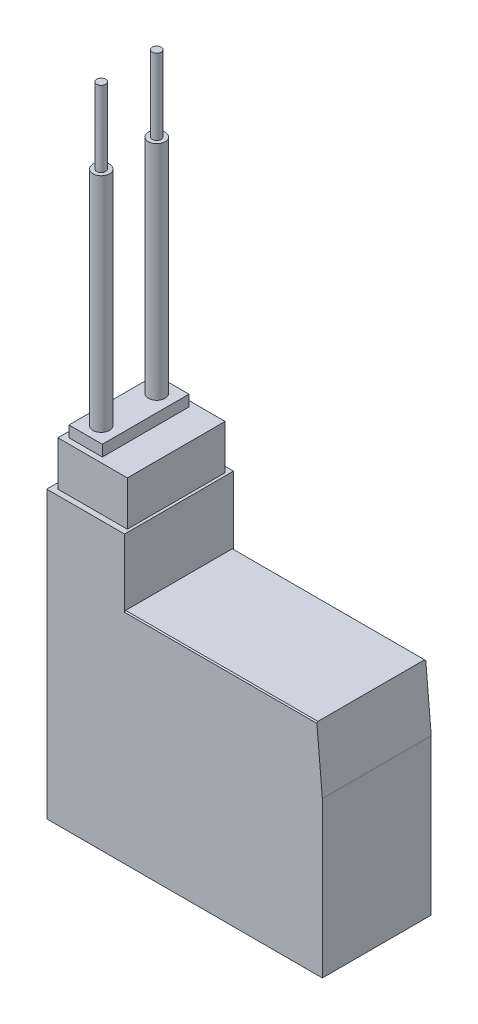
ISO-10303-21;
HEADER;
FILE_DESCRIPTION(('STEP AP214'),'2;1');
FILE_NAME('part.step','',(''),(''),'','','');
FILE_SCHEMA(('AUTOMOTIVE_DESIGN { 1 0 10303 214 1 1 1 1 }'));
ENDSEC;
DATA;
#1=APPLICATION_CONTEXT('core data for automotive mechanical design processes');
#2=APPLICATION_PROTOCOL_DEFINITION('international standard','automotive_design',2000,#1);
#3=PRODUCT_CONTEXT('',#1,'mechanical');
#4=PRODUCT('Part','Part','',(#3));
#5=PRODUCT_RELATED_PRODUCT_CATEGORY('part','',(#4));
#6=PRODUCT_DEFINITION_FORMATION('','',#4);
#7=PRODUCT_DEFINITION_CONTEXT('part definition',#1,'design');
#8=PRODUCT_DEFINITION('design','',#6,#7);
#9=PRODUCT_DEFINITION_SHAPE('','',#8);
#10=(LENGTH_UNIT() NAMED_UNIT(*) SI_UNIT(.MILLI.,.METRE.));
#11=(NAMED_UNIT(*) PLANE_ANGLE_UNIT() SI_UNIT($,.RADIAN.));
#12=(NAMED_UNIT(*) SI_UNIT($,.STERADIAN.) SOLID_ANGLE_UNIT());
#13=UNCERTAINTY_MEASURE_WITH_UNIT(LENGTH_MEASURE(1.E-05),#10,'distance_accuracy_value','');
#14=(GEOMETRIC_REPRESENTATION_CONTEXT(3) GLOBAL_UNCERTAINTY_ASSIGNED_CONTEXT((#13)) GLOBAL_UNIT_ASSIGNED_CONTEXT((#10,
#11,#12)) REPRESENTATION_CONTEXT('',''));
#15=CARTESIAN_POINT('',(0.,0.,0.));
#16=DIRECTION('',(0.,0.,1.));
#17=DIRECTION('',(1.,0.,0.));
#18=AXIS2_PLACEMENT_3D('',#15,#16,#17);
#19=CARTESIAN_POINT('',(2.5,50.7,-2.5));
#20=DIRECTION('',(0.,1.,0.));
#21=DIRECTION('',(0.,0.,1.));
#22=AXIS2_PLACEMENT_3D('',#19,#20,#21);
#23=PLANE('',#22);
#24=CARTESIAN_POINT('',(2.5,50.7,-2.5));
#25=DIRECTION('',(0.,1.,0.));
#26=DIRECTION('',(0.,0.,1.));
#27=AXIS2_PLACEMENT_3D('',#24,#25,#26);
#28=CIRCLE('',#27,0.75);
#29=CARTESIAN_POINT('',(2.5,50.7,-1.75));
#30=VERTEX_POINT('',#29);
#31=EDGE_CURVE('E157',#30,#30,#28,.T.);
#32=ORIENTED_EDGE('',*,*,#31,.T.);
#33=EDGE_LOOP('',(#32));
#34=FACE_BOUND('',#33,.T.);
#35=CARTESIAN_POINT('',(2.5,50.7,-2.5));
#36=DIRECTION('',(0.,1.,0.));
#37=DIRECTION('',(0.,0.,1.));
#38=AXIS2_PLACEMENT_3D('',#35,#36,#37);
#39=CIRCLE('',#38,0.4);
#40=CARTESIAN_POINT('',(2.5,50.7,-2.1));
#41=VERTEX_POINT('',#40);
#42=EDGE_CURVE('E430',#41,#41,#39,.T.);
#43=ORIENTED_EDGE('',*,*,#42,.F.);
#44=EDGE_LOOP('',(#43));
#45=FACE_BOUND('',#44,.T.);
#46=ADVANCED_FACE('F29',(#34,#45),#23,.T.);
#47=CARTESIAN_POINT('',(2.5,50.7,2.5));
#48=DIRECTION('',(0.,-1.,0.));
#49=DIRECTION('',(0.,0.,-1.));
#50=AXIS2_PLACEMENT_3D('',#47,#48,#49);
#51=PLANE('',#50);
#52=CARTESIAN_POINT('',(2.5,50.7,2.5));
#53=DIRECTION('',(0.,1.,0.));
#54=DIRECTION('',(0.,0.,-1.));
#55=AXIS2_PLACEMENT_3D('',#52,#53,#54);
#56=CIRCLE('',#55,0.75);
#57=CARTESIAN_POINT('',(2.5,50.7,1.75));
#58=VERTEX_POINT('',#57);
#59=EDGE_CURVE('E427',#58,#58,#56,.T.);
#60=ORIENTED_EDGE('',*,*,#59,.T.);
#61=EDGE_LOOP('',(#60));
#62=FACE_BOUND('',#61,.T.);
#63=CARTESIAN_POINT('',(2.5,50.7,2.5));
#64=DIRECTION('',(0.,-1.,0.));
#65=DIRECTION('',(0.,0.,-1.));
#66=AXIS2_PLACEMENT_3D('',#63,#64,#65);
#67=CIRCLE('',#66,0.4);
#68=CARTESIAN_POINT('',(2.5,50.7,2.1));
#69=VERTEX_POINT('',#68);
#70=EDGE_CURVE('E291',#69,#69,#67,.F.);
#71=ORIENTED_EDGE('',*,*,#70,.F.);
#72=EDGE_LOOP('',(#71));
#73=FACE_BOUND('',#72,.T.);
#74=ADVANCED_FACE('F307',(#62,#73),#51,.F.);
#75=CARTESIAN_POINT('',(1.,30.7,-3.9));
#76=DIRECTION('',(0.,1.,0.));
#77=DIRECTION('',(0.,0.,1.));
#78=AXIS2_PLACEMENT_3D('',#75,#76,#77);
#79=PLANE('',#78);
#80=CARTESIAN_POINT('',(2.5,30.7,-2.5));
#81=DIRECTION('',(0.,1.,0.));
#82=DIRECTION('',(0.,0.,1.));
#83=AXIS2_PLACEMENT_3D('',#80,#81,#82);
#84=CIRCLE('',#83,0.75);
#85=CARTESIAN_POINT('',(2.5,30.7,-1.75));
#86=VERTEX_POINT('',#85);
#87=EDGE_CURVE('E435',#86,#86,#84,.T.);
#88=ORIENTED_EDGE('',*,*,#87,.F.);
#89=EDGE_LOOP('',(#88));
#90=FACE_BOUND('',#89,.T.);
#91=DIRECTION('',(0.,0.,1.));
#92=VECTOR('',#91,1.);
#93=CARTESIAN_POINT('',(1.,30.7,-3.9));
#94=LINE('',#93,#92);
#95=CARTESIAN_POINT('',(1.,30.7,-3.9));
#96=VERTEX_POINT('',#95);
#97=CARTESIAN_POINT('',(1.,30.7,3.9));
#98=VERTEX_POINT('',#97);
#99=EDGE_CURVE('E168',#96,#98,#94,.T.);
#100=ORIENTED_EDGE('',*,*,#99,.T.);
#101=DIRECTION('',(1.,0.,0.));
#102=VECTOR('',#101,1.);
#103=CARTESIAN_POINT('',(1.,30.7,3.9));
#104=LINE('',#103,#102);
#105=CARTESIAN_POINT('',(4.,30.7,3.9));
#106=VERTEX_POINT('',#105);
#107=EDGE_CURVE('E443',#98,#106,#104,.T.);
#108=ORIENTED_EDGE('',*,*,#107,.T.);
#109=DIRECTION('',(0.,0.,-1.));
#110=VECTOR('',#109,1.);
#111=CARTESIAN_POINT('',(4.,30.7,-3.9));
#112=LINE('',#111,#110);
#113=CARTESIAN_POINT('',(4.,30.7,-3.9));
#114=VERTEX_POINT('',#113);
#115=EDGE_CURVE('E177',#106,#114,#112,.T.);
#116=ORIENTED_EDGE('',*,*,#115,.T.);
#117=DIRECTION('',(-1.,0.,0.));
#118=VECTOR('',#117,1.);
#119=CARTESIAN_POINT('',(1.,30.7,-3.9));
#120=LINE('',#119,#118);
#121=EDGE_CURVE('E173',#114,#96,#120,.T.);
#122=ORIENTED_EDGE('',*,*,#121,.T.);
#123=EDGE_LOOP('',(#100,#108,#116,#122));
#124=FACE_BOUND('',#123,.T.);
#125=CARTESIAN_POINT('',(2.5,30.7,2.5));
#126=DIRECTION('',(0.,1.,0.));
#127=DIRECTION('',(0.,0.,-1.));
#128=AXIS2_PLACEMENT_3D('',#125,#126,#127);
#129=CIRCLE('',#128,0.75);
#130=CARTESIAN_POINT('',(2.5,30.7,1.75));
#131=VERTEX_POINT('',#130);
#132=EDGE_CURVE('E423',#131,#131,#129,.T.);
#133=ORIENTED_EDGE('',*,*,#132,.F.);
#134=EDGE_LOOP('',(#133));
#135=FACE_BOUND('',#134,.T.);
#136=ADVANCED_FACE('F309',(#90,#124,#135),#79,.T.);
#137=CARTESIAN_POINT('',(0.500000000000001,29.7,4.4));
#138=DIRECTION('',(0.,-1.,0.));
#139=DIRECTION('',(0.,0.,-1.));
#140=AXIS2_PLACEMENT_3D('',#137,#138,#139);
#141=PLANE('',#140);
#142=DIRECTION('',(0.,0.,1.));
#143=VECTOR('',#142,1.);
#144=CARTESIAN_POINT('',(0.500000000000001,29.7,4.4));
#145=LINE('',#144,#143);
#146=CARTESIAN_POINT('',(0.5,29.7,-4.4));
#147=VERTEX_POINT('',#146);
#148=CARTESIAN_POINT('',(0.500000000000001,29.7,4.4));
#149=VERTEX_POINT('',#148);
#150=EDGE_CURVE('E195',#147,#149,#145,.T.);
#151=ORIENTED_EDGE('',*,*,#150,.T.);
#152=DIRECTION('',(1.,0.,0.));
#153=VECTOR('',#152,1.);
#154=CARTESIAN_POINT('',(0.500000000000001,29.7,4.4));
#155=LINE('',#154,#153);
#156=CARTESIAN_POINT('',(6.75,29.7,4.4));
#157=VERTEX_POINT('',#156);
#158=EDGE_CURVE('E198',#149,#157,#155,.T.);
#159=ORIENTED_EDGE('',*,*,#158,.T.);
#160=DIRECTION('',(0.,0.,-1.));
#161=VECTOR('',#160,1.);
#162=CARTESIAN_POINT('',(6.75,29.7,4.4));
#163=LINE('',#162,#161);
#164=CARTESIAN_POINT('',(6.75,29.7,-4.4));
#165=VERTEX_POINT('',#164);
#166=EDGE_CURVE('E200',#157,#165,#163,.T.);
#167=ORIENTED_EDGE('',*,*,#166,.T.);
#168=DIRECTION('',(-1.,0.,0.));
#169=VECTOR('',#168,1.);
#170=CARTESIAN_POINT('',(0.5,29.7,-4.4));
#171=LINE('',#170,#169);
#172=EDGE_CURVE('E202',#165,#147,#171,.T.);
#173=ORIENTED_EDGE('',*,*,#172,.T.);
#174=EDGE_LOOP('',(#151,#159,#167,#173));
#175=FACE_BOUND('',#174,.T.);
#176=DIRECTION('',(0.,0.,1.));
#177=VECTOR('',#176,1.);
#178=CARTESIAN_POINT('',(1.,29.7,-3.9));
#179=LINE('',#178,#177);
#180=CARTESIAN_POINT('',(1.,29.7,-3.9));
#181=VERTEX_POINT('',#180);
#182=CARTESIAN_POINT('',(1.,29.7,3.9));
#183=VERTEX_POINT('',#182);
#184=EDGE_CURVE('E146',#181,#183,#179,.T.);
#185=ORIENTED_EDGE('',*,*,#184,.F.);
#186=DIRECTION('',(-1.,0.,0.));
#187=VECTOR('',#186,1.);
#188=CARTESIAN_POINT('',(1.,29.7,-3.9));
#189=LINE('',#188,#187);
#190=CARTESIAN_POINT('',(4.,29.7,-3.9));
#191=VERTEX_POINT('',#190);
#192=EDGE_CURVE('E149',#191,#181,#189,.T.);
#193=ORIENTED_EDGE('',*,*,#192,.F.);
#194=DIRECTION('',(0.,0.,-1.));
#195=VECTOR('',#194,1.);
#196=CARTESIAN_POINT('',(4.,29.7,-3.9));
#197=LINE('',#196,#195);
#198=CARTESIAN_POINT('',(4.,29.7,3.9));
#199=VERTEX_POINT('',#198);
#200=EDGE_CURVE('E169',#199,#191,#197,.T.);
#201=ORIENTED_EDGE('',*,*,#200,.F.);
#202=DIRECTION('',(1.,0.,0.));
#203=VECTOR('',#202,1.);
#204=CARTESIAN_POINT('',(1.,29.7,3.9));
#205=LINE('',#204,#203);
#206=EDGE_CURVE('E152',#183,#199,#205,.T.);
#207=ORIENTED_EDGE('',*,*,#206,.F.);
#208=EDGE_LOOP('',(#185,#193,#201,#207));
#209=FACE_BOUND('',#208,.T.);
#210=ADVANCED_FACE('F148',(#175,#209),#141,.F.);
#211=CARTESIAN_POINT('',(0.,25.7,-14.1195444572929));
#212=DIRECTION('',(0.,1.,0.));
#213=DIRECTION('',(0.,0.,1.));
#214=AXIS2_PLACEMENT_3D('',#211,#212,#213);
#215=PLANE('',#214);
#216=DIRECTION('',(0.,0.,1.));
#217=VECTOR('',#216,1.);
#218=CARTESIAN_POINT('',(7.,25.7,-14.1195444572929));
#219=LINE('',#218,#217);
#220=CARTESIAN_POINT('',(7.,25.7,-4.9));
#221=VERTEX_POINT('',#220);
#222=CARTESIAN_POINT('',(7.,25.7,4.9));
#223=VERTEX_POINT('',#222);
#224=EDGE_CURVE('E223',#221,#223,#219,.T.);
#225=ORIENTED_EDGE('',*,*,#224,.F.);
#226=DIRECTION('',(-1.,0.,0.));
#227=VECTOR('',#226,1.);
#228=CARTESIAN_POINT('',(0.,25.7,-4.9));
#229=LINE('',#228,#227);
#230=CARTESIAN_POINT('',(0.,25.7,-4.9));
#231=VERTEX_POINT('',#230);
#232=EDGE_CURVE('E219',#221,#231,#229,.T.);
#233=ORIENTED_EDGE('',*,*,#232,.T.);
#234=DIRECTION('',(0.,0.,1.));
#235=VECTOR('',#234,1.);
#236=CARTESIAN_POINT('',(0.,25.7,-14.1195444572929));
#237=LINE('',#236,#235);
#238=CARTESIAN_POINT('',(0.,25.7,4.9));
#239=VERTEX_POINT('',#238);
#240=EDGE_CURVE('E222',#231,#239,#237,.T.);
#241=ORIENTED_EDGE('',*,*,#240,.T.);
#242=DIRECTION('',(-1.,0.,0.));
#243=VECTOR('',#242,1.);
#244=CARTESIAN_POINT('',(0.,25.7,4.9));
#245=LINE('',#244,#243);
#246=EDGE_CURVE('E215',#223,#239,#245,.T.);
#247=ORIENTED_EDGE('',*,*,#246,.F.);
#248=EDGE_LOOP('',(#225,#233,#241,#247));
#249=FACE_BOUND('',#248,.T.);
#250=DIRECTION('',(1.,0.,0.));
#251=VECTOR('',#250,1.);
#252=CARTESIAN_POINT('',(0.500000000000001,25.7,4.4));
#253=LINE('',#252,#251);
#254=CARTESIAN_POINT('',(0.500000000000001,25.7,4.4));
#255=VERTEX_POINT('',#254);
#256=CARTESIAN_POINT('',(6.75,25.7,4.4));
#257=VERTEX_POINT('',#256);
#258=EDGE_CURVE('E188',#255,#257,#253,.T.);
#259=ORIENTED_EDGE('',*,*,#258,.F.);
#260=DIRECTION('',(0.,0.,1.));
#261=VECTOR('',#260,1.);
#262=CARTESIAN_POINT('',(0.500000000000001,25.7,4.4));
#263=LINE('',#262,#261);
#264=CARTESIAN_POINT('',(0.5,25.7,-4.4));
#265=VERTEX_POINT('',#264);
#266=EDGE_CURVE('E185',#265,#255,#263,.T.);
#267=ORIENTED_EDGE('',*,*,#266,.F.);
#268=DIRECTION('',(-1.,0.,0.));
#269=VECTOR('',#268,1.);
#270=CARTESIAN_POINT('',(0.5,25.7,-4.4));
#271=LINE('',#270,#269);
#272=CARTESIAN_POINT('',(6.75,25.7,-4.4));
#273=VERTEX_POINT('',#272);
#274=EDGE_CURVE('E193',#273,#265,#271,.T.);
#275=ORIENTED_EDGE('',*,*,#274,.F.);
#276=DIRECTION('',(0.,0.,-1.));
#277=VECTOR('',#276,1.);
#278=CARTESIAN_POINT('',(6.75,25.7,4.4));
#279=LINE('',#278,#277);
#280=EDGE_CURVE('E190',#257,#273,#279,.T.);
#281=ORIENTED_EDGE('',*,*,#280,.F.);
#282=EDGE_LOOP('',(#259,#267,#275,#281));
#283=FACE_BOUND('',#282,.T.);
#284=ADVANCED_FACE('F348',(#249,#283),#215,.T.);
#285=CARTESIAN_POINT('',(0.,19.7,-4.9));
#286=DIRECTION('',(0.,1.,0.));
#287=DIRECTION('',(0.,0.,1.));
#288=AXIS2_PLACEMENT_3D('',#285,#286,#287);
#289=PLANE('',#288);
#290=DIRECTION('',(0.,0.,1.));
#291=VECTOR('',#290,1.);
#292=CARTESIAN_POINT('',(7.,19.7,-14.1195444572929));
#293=LINE('',#292,#291);
#294=CARTESIAN_POINT('',(7.,19.7,-4.8));
#295=VERTEX_POINT('',#294);
#296=CARTESIAN_POINT('',(7.,19.7,4.8));
#297=VERTEX_POINT('',#296);
#298=EDGE_CURVE('E218',#295,#297,#293,.T.);
#299=ORIENTED_EDGE('',*,*,#298,.T.);
#300=DIRECTION('',(1.,0.,0.));
#301=VECTOR('',#300,1.);
#302=CARTESIAN_POINT('',(24.3,19.7,4.8));
#303=LINE('',#302,#301);
#304=CARTESIAN_POINT('',(24.3,19.7,4.8));
#305=VERTEX_POINT('',#304);
#306=EDGE_CURVE('E240',#297,#305,#303,.T.);
#307=ORIENTED_EDGE('',*,*,#306,.T.);
#308=DIRECTION('',(0.,0.,1.));
#309=VECTOR('',#308,1.);
#310=CARTESIAN_POINT('',(24.3,19.7,-4.9));
#311=LINE('',#310,#309);
#312=CARTESIAN_POINT('',(24.3,19.7,-4.8));
#313=VERTEX_POINT('',#312);
#314=EDGE_CURVE('E268',#313,#305,#311,.T.);
#315=ORIENTED_EDGE('',*,*,#314,.F.);
#316=DIRECTION('',(-1.,0.,0.));
#317=VECTOR('',#316,1.);
#318=CARTESIAN_POINT('',(0.,19.7,-4.8));
#319=LINE('',#318,#317);
#320=EDGE_CURVE('E237',#313,#295,#319,.T.);
#321=ORIENTED_EDGE('',*,*,#320,.T.);
#322=EDGE_LOOP('',(#299,#307,#315,#321));
#323=FACE_BOUND('',#322,.T.);
#324=ADVANCED_FACE('F256',(#323),#289,.T.);
#325=CARTESIAN_POINT('',(0.,0.,-4.9));
#326=DIRECTION('',(-1.,0.,0.));
#327=DIRECTION('',(0.,0.,1.));
#328=AXIS2_PLACEMENT_3D('',#325,#326,#327);
#329=PLANE('',#328);
#330=DIRECTION('',(0.,-1.,0.));
#331=VECTOR('',#330,1.);
#332=CARTESIAN_POINT('',(0.,0.,4.9));
#333=LINE('',#332,#331);
#334=CARTESIAN_POINT('',(0.,0.,4.9));
#335=VERTEX_POINT('',#334);
#336=EDGE_CURVE('E226',#239,#335,#333,.T.);
#337=ORIENTED_EDGE('',*,*,#336,.F.);
#338=ORIENTED_EDGE('',*,*,#240,.F.);
#339=DIRECTION('',(0.,-1.,0.));
#340=VECTOR('',#339,1.);
#341=CARTESIAN_POINT('',(0.,0.,-4.9));
#342=LINE('',#341,#340);
#343=CARTESIAN_POINT('',(0.,0.,-4.9));
#344=VERTEX_POINT('',#343);
#345=EDGE_CURVE('E274',#231,#344,#342,.T.);
#346=ORIENTED_EDGE('',*,*,#345,.T.);
#347=DIRECTION('',(0.,0.,1.));
#348=VECTOR('',#347,1.);
#349=CARTESIAN_POINT('',(0.,0.,-4.9));
#350=LINE('',#349,#348);
#351=EDGE_CURVE('E289',#344,#335,#350,.T.);
#352=ORIENTED_EDGE('',*,*,#351,.T.);
#353=EDGE_LOOP('',(#337,#338,#346,#352));
#354=FACE_BOUND('',#353,.T.);
#355=ADVANCED_FACE('F31',(#354),#329,.T.);
#356=CARTESIAN_POINT('',(24.3,19.7,-4.9));
#357=DIRECTION('',(0.996194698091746,0.0871557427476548,0.));
#358=DIRECTION('',(-0.0871557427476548,0.996194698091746,0.));
#359=AXIS2_PLACEMENT_3D('',#356,#357,#358);
#360=PLANE('',#359);
#361=ORIENTED_EDGE('',*,*,#314,.T.);
#362=DIRECTION('',(0.0617457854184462,-0.705757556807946,0.705757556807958));
#363=VECTOR('',#362,1.);
#364=CARTESIAN_POINT('',(23.8772977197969,24.5315091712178,-0.0315091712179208));
#365=LINE('',#364,#363);
#366=CARTESIAN_POINT('',(24.3087488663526,19.6,4.9));
#367=VERTEX_POINT('',#366);
#368=EDGE_CURVE('E244',#305,#367,#365,.T.);
#369=ORIENTED_EDGE('',*,*,#368,.T.);
#370=DIRECTION('',(-0.0871557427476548,0.996194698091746,0.));
#371=VECTOR('',#370,1.);
#372=CARTESIAN_POINT('',(24.3,19.7,4.9));
#373=LINE('',#372,#371);
#374=CARTESIAN_POINT('',(24.8,13.9849738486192,4.9));
#375=VERTEX_POINT('',#374);
#376=EDGE_CURVE('E266',#375,#367,#373,.T.);
#377=ORIENTED_EDGE('',*,*,#376,.F.);
#378=DIRECTION('',(0.,0.,1.));
#379=VECTOR('',#378,1.);
#380=CARTESIAN_POINT('',(24.8,13.9849738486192,-4.9));
#381=LINE('',#380,#379);
#382=CARTESIAN_POINT('',(24.8,13.9849738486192,-4.9));
#383=VERTEX_POINT('',#382);
#384=EDGE_CURVE('E292',#383,#375,#381,.T.);
#385=ORIENTED_EDGE('',*,*,#384,.F.);
#386=DIRECTION('',(-0.0871557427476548,0.996194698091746,0.));
#387=VECTOR('',#386,1.);
#388=CARTESIAN_POINT('',(24.3,19.7,-4.9));
#389=LINE('',#388,#387);
#390=CARTESIAN_POINT('',(24.3087488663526,19.6,-4.9));
#391=VERTEX_POINT('',#390);
#392=EDGE_CURVE('E287',#383,#391,#389,.T.);
#393=ORIENTED_EDGE('',*,*,#392,.T.);
#394=DIRECTION('',(0.0617457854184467,-0.705757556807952,-0.705757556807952));
#395=VECTOR('',#394,1.);
#396=CARTESIAN_POINT('',(24.304357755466,19.6501906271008,-4.84980937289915));
#397=LINE('',#396,#395);
#398=EDGE_CURVE('E242',#391,#313,#397,.F.);
#399=ORIENTED_EDGE('',*,*,#398,.T.);
#400=EDGE_LOOP('',(#361,#369,#377,#385,#393,#399));
#401=FACE_BOUND('',#400,.T.);
#402=ADVANCED_FACE('F265',(#401),#360,.T.);
#403=CARTESIAN_POINT('',(24.8,0.,-4.9));
#404=DIRECTION('',(1.,0.,0.));
#405=DIRECTION('',(0.,0.,-1.));
#406=AXIS2_PLACEMENT_3D('',#403,#404,#405);
#407=PLANE('',#406);
#408=DIRECTION('',(0.,1.,0.));
#409=VECTOR('',#408,1.);
#410=CARTESIAN_POINT('',(24.8,0.,4.9));
#411=LINE('',#410,#409);
#412=CARTESIAN_POINT('',(24.8,0.,4.9));
#413=VERTEX_POINT('',#412);
#414=EDGE_CURVE('E273',#413,#375,#411,.T.);
#415=ORIENTED_EDGE('',*,*,#414,.F.);
#416=DIRECTION('',(0.,0.,1.));
#417=VECTOR('',#416,1.);
#418=CARTESIAN_POINT('',(24.8,0.,-4.9));
#419=LINE('',#418,#417);
#420=CARTESIAN_POINT('',(24.8,0.,-4.9));
#421=VERTEX_POINT('',#420);
#422=EDGE_CURVE('E294',#421,#413,#419,.T.);
#423=ORIENTED_EDGE('',*,*,#422,.F.);
#424=DIRECTION('',(0.,1.,0.));
#425=VECTOR('',#424,1.);
#426=CARTESIAN_POINT('',(24.8,0.,-4.9));
#427=LINE('',#426,#425);
#428=EDGE_CURVE('E284',#421,#383,#427,.T.);
#429=ORIENTED_EDGE('',*,*,#428,.T.);
#430=ORIENTED_EDGE('',*,*,#384,.T.);
#431=EDGE_LOOP('',(#415,#423,#429,#430));
#432=FACE_BOUND('',#431,.T.);
#433=ADVANCED_FACE('F380',(#432),#407,.T.);
#434=CARTESIAN_POINT('',(0.,0.,-4.9));
#435=DIRECTION('',(0.,-1.,0.));
#436=DIRECTION('',(0.,0.,-1.));
#437=AXIS2_PLACEMENT_3D('',#434,#435,#436);
#438=PLANE('',#437);
#439=DIRECTION('',(1.,0.,0.));
#440=VECTOR('',#439,1.);
#441=CARTESIAN_POINT('',(0.,0.,4.9));
#442=LINE('',#441,#440);
#443=EDGE_CURVE('E279',#335,#413,#442,.T.);
#444=ORIENTED_EDGE('',*,*,#443,.F.);
#445=ORIENTED_EDGE('',*,*,#351,.F.);
#446=DIRECTION('',(1.,0.,0.));
#447=VECTOR('',#446,1.);
#448=CARTESIAN_POINT('',(0.,0.,-4.9));
#449=LINE('',#448,#447);
#450=EDGE_CURVE('E277',#344,#421,#449,.T.);
#451=ORIENTED_EDGE('',*,*,#450,.T.);
#452=ORIENTED_EDGE('',*,*,#422,.T.);
#453=EDGE_LOOP('',(#444,#445,#451,#452));
#454=FACE_BOUND('',#453,.T.);
#455=ADVANCED_FACE('F375',(#454),#438,.T.);
#456=CARTESIAN_POINT('',(0.,19.7,-4.9));
#457=DIRECTION('',(0.,0.,-1.));
#458=DIRECTION('',(-1.,0.,0.));
#459=AXIS2_PLACEMENT_3D('',#456,#457,#458);
#460=PLANE('',#459);
#461=DIRECTION('',(0.,1.,0.));
#462=VECTOR('',#461,1.);
#463=CARTESIAN_POINT('',(7.,19.7,-4.9));
#464=LINE('',#463,#462);
#465=CARTESIAN_POINT('',(7.,19.6,-4.9));
#466=VERTEX_POINT('',#465);
#467=EDGE_CURVE('E44',#466,#221,#464,.T.);
#468=ORIENTED_EDGE('',*,*,#467,.F.);
#469=DIRECTION('',(1.,0.,0.));
#470=VECTOR('',#469,1.);
#471=CARTESIAN_POINT('',(0.,19.6,-4.9));
#472=LINE('',#471,#470);
#473=EDGE_CURVE('E48',#466,#391,#472,.T.);
#474=ORIENTED_EDGE('',*,*,#473,.T.);
#475=ORIENTED_EDGE('',*,*,#392,.F.);
#476=ORIENTED_EDGE('',*,*,#428,.F.);
#477=ORIENTED_EDGE('',*,*,#450,.F.);
#478=ORIENTED_EDGE('',*,*,#345,.F.);
#479=ORIENTED_EDGE('',*,*,#232,.F.);
#480=EDGE_LOOP('',(#468,#474,#475,#476,#477,#478,#479));
#481=FACE_BOUND('',#480,.T.);
#482=ADVANCED_FACE('F372',(#481),#460,.T.);
#483=CARTESIAN_POINT('',(0.,19.7,4.9));
#484=DIRECTION('',(0.,0.,-1.));
#485=DIRECTION('',(-1.,0.,0.));
#486=AXIS2_PLACEMENT_3D('',#483,#484,#485);
#487=PLANE('',#486);
#488=ORIENTED_EDGE('',*,*,#376,.T.);
#489=DIRECTION('',(-1.,0.,0.));
#490=VECTOR('',#489,1.);
#491=CARTESIAN_POINT('',(7.,19.6,4.9));
#492=LINE('',#491,#490);
#493=CARTESIAN_POINT('',(7.,19.6,4.9));
#494=VERTEX_POINT('',#493);
#495=EDGE_CURVE('E235',#367,#494,#492,.T.);
#496=ORIENTED_EDGE('',*,*,#495,.T.);
#497=DIRECTION('',(0.,1.,0.));
#498=VECTOR('',#497,1.);
#499=CARTESIAN_POINT('',(7.,19.7,4.9));
#500=LINE('',#499,#498);
#501=EDGE_CURVE('E214',#494,#223,#500,.T.);
#502=ORIENTED_EDGE('',*,*,#501,.T.);
#503=ORIENTED_EDGE('',*,*,#246,.T.);
#504=ORIENTED_EDGE('',*,*,#336,.T.);
#505=ORIENTED_EDGE('',*,*,#443,.T.);
#506=ORIENTED_EDGE('',*,*,#414,.T.);
#507=EDGE_LOOP('',(#488,#496,#502,#503,#504,#505,#506));
#508=FACE_BOUND('',#507,.T.);
#509=ADVANCED_FACE('F270',(#508),#487,.F.);
#510=CARTESIAN_POINT('',(7.,19.7,-14.1195444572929));
#511=DIRECTION('',(1.,0.,0.));
#512=DIRECTION('',(0.,0.,-1.));
#513=AXIS2_PLACEMENT_3D('',#510,#511,#512);
#514=PLANE('',#513);
#515=ORIENTED_EDGE('',*,*,#298,.F.);
#516=DIRECTION('',(0.,0.707106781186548,0.707106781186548));
#517=VECTOR('',#516,1.);
#518=CARTESIAN_POINT('',(7.,19.7,-4.8));
#519=LINE('',#518,#517);
#520=EDGE_CURVE('E11',#295,#466,#519,.F.);
#521=ORIENTED_EDGE('',*,*,#520,.T.);
#522=ORIENTED_EDGE('',*,*,#467,.T.);
#523=ORIENTED_EDGE('',*,*,#224,.T.);
#524=ORIENTED_EDGE('',*,*,#501,.F.);
#525=DIRECTION('',(0.,0.707106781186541,-0.707106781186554));
#526=VECTOR('',#525,1.);
#527=CARTESIAN_POINT('',(7.,19.6,4.9));
#528=LINE('',#527,#526);
#529=EDGE_CURVE('E37',#494,#297,#528,.T.);
#530=ORIENTED_EDGE('',*,*,#529,.T.);
#531=EDGE_LOOP('',(#515,#521,#522,#523,#524,#530));
#532=FACE_BOUND('',#531,.T.);
#533=ADVANCED_FACE('F249',(#532),#514,.T.);
#534=CARTESIAN_POINT('',(0.500000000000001,29.7,4.4));
#535=DIRECTION('',(1.,0.,0.));
#536=DIRECTION('',(0.,0.,-1.));
#537=AXIS2_PLACEMENT_3D('',#534,#535,#536);
#538=PLANE('',#537);
#539=ORIENTED_EDGE('',*,*,#266,.T.);
#540=DIRECTION('',(0.,-1.,0.));
#541=VECTOR('',#540,1.);
#542=CARTESIAN_POINT('',(0.500000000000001,29.7,4.4));
#543=LINE('',#542,#541);
#544=EDGE_CURVE('E212',#149,#255,#543,.T.);
#545=ORIENTED_EDGE('',*,*,#544,.F.);
#546=ORIENTED_EDGE('',*,*,#150,.F.);
#547=DIRECTION('',(0.,-1.,0.));
#548=VECTOR('',#547,1.);
#549=CARTESIAN_POINT('',(0.5,29.7,-4.4));
#550=LINE('',#549,#548);
#551=EDGE_CURVE('E204',#147,#265,#550,.T.);
#552=ORIENTED_EDGE('',*,*,#551,.T.);
#553=EDGE_LOOP('',(#539,#545,#546,#552));
#554=FACE_BOUND('',#553,.T.);
#555=ADVANCED_FACE('F360',(#554),#538,.F.);
#556=CARTESIAN_POINT('',(0.500000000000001,29.7,4.4));
#557=DIRECTION('',(0.,0.,-1.));
#558=DIRECTION('',(-1.,0.,0.));
#559=AXIS2_PLACEMENT_3D('',#556,#557,#558);
#560=PLANE('',#559);
#561=ORIENTED_EDGE('',*,*,#258,.T.);
#562=DIRECTION('',(0.,-1.,0.));
#563=VECTOR('',#562,1.);
#564=CARTESIAN_POINT('',(6.75,29.7,4.4));
#565=LINE('',#564,#563);
#566=EDGE_CURVE('E209',#157,#257,#565,.T.);
#567=ORIENTED_EDGE('',*,*,#566,.F.);
#568=ORIENTED_EDGE('',*,*,#158,.F.);
#569=ORIENTED_EDGE('',*,*,#544,.T.);
#570=EDGE_LOOP('',(#561,#567,#568,#569));
#571=FACE_BOUND('',#570,.T.);
#572=ADVANCED_FACE('F356',(#571),#560,.F.);
#573=CARTESIAN_POINT('',(6.75,29.7,4.4));
#574=DIRECTION('',(-1.,0.,0.));
#575=DIRECTION('',(0.,0.,1.));
#576=AXIS2_PLACEMENT_3D('',#573,#574,#575);
#577=PLANE('',#576);
#578=ORIENTED_EDGE('',*,*,#280,.T.);
#579=DIRECTION('',(0.,-1.,0.));
#580=VECTOR('',#579,1.);
#581=CARTESIAN_POINT('',(6.75,29.7,-4.4));
#582=LINE('',#581,#580);
#583=EDGE_CURVE('E207',#165,#273,#582,.T.);
#584=ORIENTED_EDGE('',*,*,#583,.F.);
#585=ORIENTED_EDGE('',*,*,#166,.F.);
#586=ORIENTED_EDGE('',*,*,#566,.T.);
#587=EDGE_LOOP('',(#578,#584,#585,#586));
#588=FACE_BOUND('',#587,.T.);
#589=ADVANCED_FACE('F352',(#588),#577,.F.);
#590=CARTESIAN_POINT('',(0.5,29.7,-4.4));
#591=DIRECTION('',(0.,0.,1.));
#592=DIRECTION('',(1.,0.,0.));
#593=AXIS2_PLACEMENT_3D('',#590,#591,#592);
#594=PLANE('',#593);
#595=ORIENTED_EDGE('',*,*,#274,.T.);
#596=ORIENTED_EDGE('',*,*,#551,.F.);
#597=ORIENTED_EDGE('',*,*,#172,.F.);
#598=ORIENTED_EDGE('',*,*,#583,.T.);
#599=EDGE_LOOP('',(#595,#596,#597,#598));
#600=FACE_BOUND('',#599,.T.);
#601=ADVANCED_FACE('F345',(#600),#594,.F.);
#602=CARTESIAN_POINT('',(1.,30.7,-3.9));
#603=DIRECTION('',(1.,0.,0.));
#604=DIRECTION('',(0.,0.,-1.));
#605=AXIS2_PLACEMENT_3D('',#602,#603,#604);
#606=PLANE('',#605);
#607=ORIENTED_EDGE('',*,*,#184,.T.);
#608=DIRECTION('',(0.,-1.,0.));
#609=VECTOR('',#608,1.);
#610=CARTESIAN_POINT('',(1.,30.7,3.9));
#611=LINE('',#610,#609);
#612=EDGE_CURVE('E183',#98,#183,#611,.T.);
#613=ORIENTED_EDGE('',*,*,#612,.F.);
#614=ORIENTED_EDGE('',*,*,#99,.F.);
#615=DIRECTION('',(0.,-1.,0.));
#616=VECTOR('',#615,1.);
#617=CARTESIAN_POINT('',(1.,30.7,-3.9));
#618=LINE('',#617,#616);
#619=EDGE_CURVE('E164',#96,#181,#618,.T.);
#620=ORIENTED_EDGE('',*,*,#619,.T.);
#621=EDGE_LOOP('',(#607,#613,#614,#620));
#622=FACE_BOUND('',#621,.T.);
#623=ADVANCED_FACE('F171',(#622),#606,.F.);
#624=CARTESIAN_POINT('',(1.,30.7,3.9));
#625=DIRECTION('',(0.,0.,-1.));
#626=DIRECTION('',(-1.,0.,0.));
#627=AXIS2_PLACEMENT_3D('',#624,#625,#626);
#628=PLANE('',#627);
#629=ORIENTED_EDGE('',*,*,#206,.T.);
#630=DIRECTION('',(0.,-1.,0.));
#631=VECTOR('',#630,1.);
#632=CARTESIAN_POINT('',(4.,30.7,3.9));
#633=LINE('',#632,#631);
#634=EDGE_CURVE('E175',#106,#199,#633,.T.);
#635=ORIENTED_EDGE('',*,*,#634,.F.);
#636=ORIENTED_EDGE('',*,*,#107,.F.);
#637=ORIENTED_EDGE('',*,*,#612,.T.);
#638=EDGE_LOOP('',(#629,#635,#636,#637));
#639=FACE_BOUND('',#638,.T.);
#640=ADVANCED_FACE('F338',(#639),#628,.F.);
#641=CARTESIAN_POINT('',(4.,30.7,-3.9));
#642=DIRECTION('',(-1.,0.,0.));
#643=DIRECTION('',(0.,0.,1.));
#644=AXIS2_PLACEMENT_3D('',#641,#642,#643);
#645=PLANE('',#644);
#646=ORIENTED_EDGE('',*,*,#200,.T.);
#647=DIRECTION('',(0.,-1.,0.));
#648=VECTOR('',#647,1.);
#649=CARTESIAN_POINT('',(4.,30.7,-3.9));
#650=LINE('',#649,#648);
#651=EDGE_CURVE('E167',#114,#191,#650,.T.);
#652=ORIENTED_EDGE('',*,*,#651,.F.);
#653=ORIENTED_EDGE('',*,*,#115,.F.);
#654=ORIENTED_EDGE('',*,*,#634,.T.);
#655=EDGE_LOOP('',(#646,#652,#653,#654));
#656=FACE_BOUND('',#655,.T.);
#657=ADVANCED_FACE('F335',(#656),#645,.F.);
#658=CARTESIAN_POINT('',(1.,30.7,-3.9));
#659=DIRECTION('',(0.,0.,1.));
#660=DIRECTION('',(1.,0.,0.));
#661=AXIS2_PLACEMENT_3D('',#658,#659,#660);
#662=PLANE('',#661);
#663=ORIENTED_EDGE('',*,*,#192,.T.);
#664=ORIENTED_EDGE('',*,*,#619,.F.);
#665=ORIENTED_EDGE('',*,*,#121,.F.);
#666=ORIENTED_EDGE('',*,*,#651,.T.);
#667=EDGE_LOOP('',(#663,#664,#665,#666));
#668=FACE_BOUND('',#667,.T.);
#669=ADVANCED_FACE('F162',(#668),#662,.F.);
#670=CARTESIAN_POINT('',(2.5,50.7,-2.5));
#671=DIRECTION('',(0.,-1.,0.));
#672=DIRECTION('',(0.,0.,-1.));
#673=AXIS2_PLACEMENT_3D('',#670,#671,#672);
#674=CYLINDRICAL_SURFACE('',#673,0.75);
#675=ORIENTED_EDGE('',*,*,#31,.F.);
#676=EDGE_LOOP('',(#675));
#677=FACE_BOUND('',#676,.T.);
#678=ORIENTED_EDGE('',*,*,#87,.T.);
#679=EDGE_LOOP('',(#678));
#680=FACE_BOUND('',#679,.T.);
#681=ADVANCED_FACE('F327',(#677,#680),#674,.T.);
#682=CARTESIAN_POINT('',(2.5,50.7,2.5));
#683=DIRECTION('',(0.,-1.,0.));
#684=DIRECTION('',(0.,0.,-1.));
#685=AXIS2_PLACEMENT_3D('',#682,#683,#684);
#686=CYLINDRICAL_SURFACE('',#685,0.75);
#687=ORIENTED_EDGE('',*,*,#59,.F.);
#688=EDGE_LOOP('',(#687));
#689=FACE_BOUND('',#688,.T.);
#690=ORIENTED_EDGE('',*,*,#132,.T.);
#691=EDGE_LOOP('',(#690));
#692=FACE_BOUND('',#691,.T.);
#693=ADVANCED_FACE('F325',(#689,#692),#686,.T.);
#694=CARTESIAN_POINT('',(2.5,57.5,2.5));
#695=DIRECTION('',(0.,-1.,0.));
#696=DIRECTION('',(0.,0.,-1.));
#697=AXIS2_PLACEMENT_3D('',#694,#695,#696);
#698=CYLINDRICAL_SURFACE('',#697,0.4);
#699=CARTESIAN_POINT('',(2.5,57.5,2.5));
#700=DIRECTION('',(0.,1.,0.));
#701=DIRECTION('',(0.,0.,1.));
#702=AXIS2_PLACEMENT_3D('',#699,#700,#701);
#703=CIRCLE('',#702,0.4);
#704=CARTESIAN_POINT('',(2.5,57.5,2.9));
#705=VERTEX_POINT('',#704);
#706=EDGE_CURVE('E422',#705,#705,#703,.T.);
#707=ORIENTED_EDGE('',*,*,#706,.F.);
#708=EDGE_LOOP('',(#707));
#709=FACE_BOUND('',#708,.T.);
#710=ORIENTED_EDGE('',*,*,#70,.T.);
#711=EDGE_LOOP('',(#710));
#712=FACE_BOUND('',#711,.T.);
#713=ADVANCED_FACE('F305',(#709,#712),#698,.T.);
#714=CARTESIAN_POINT('',(2.5,57.5,2.5));
#715=DIRECTION('',(0.,1.,0.));
#716=DIRECTION('',(0.,0.,1.));
#717=AXIS2_PLACEMENT_3D('',#714,#715,#716);
#718=PLANE('',#717);
#719=ORIENTED_EDGE('',*,*,#706,.T.);
#720=EDGE_LOOP('',(#719));
#721=FACE_BOUND('',#720,.T.);
#722=ADVANCED_FACE('F413',(#721),#718,.T.);
#723=CARTESIAN_POINT('',(2.5,57.5,-2.5));
#724=DIRECTION('',(0.,-1.,0.));
#725=DIRECTION('',(0.,0.,-1.));
#726=AXIS2_PLACEMENT_3D('',#723,#724,#725);
#727=CYLINDRICAL_SURFACE('',#726,0.4);
#728=CARTESIAN_POINT('',(2.5,57.5,-2.5));
#729=DIRECTION('',(0.,1.,0.));
#730=DIRECTION('',(0.,0.,1.));
#731=AXIS2_PLACEMENT_3D('',#728,#729,#730);
#732=CIRCLE('',#731,0.4);
#733=CARTESIAN_POINT('',(2.5,57.5,-2.1));
#734=VERTEX_POINT('',#733);
#735=EDGE_CURVE('E424',#734,#734,#732,.T.);
#736=ORIENTED_EDGE('',*,*,#735,.F.);
#737=EDGE_LOOP('',(#736));
#738=FACE_BOUND('',#737,.T.);
#739=ORIENTED_EDGE('',*,*,#42,.T.);
#740=EDGE_LOOP('',(#739));
#741=FACE_BOUND('',#740,.T.);
#742=ADVANCED_FACE('F410',(#738,#741),#727,.T.);
#743=CARTESIAN_POINT('',(2.5,57.5,-2.5));
#744=DIRECTION('',(0.,1.,0.));
#745=DIRECTION('',(0.,0.,1.));
#746=AXIS2_PLACEMENT_3D('',#743,#744,#745);
#747=PLANE('',#746);
#748=ORIENTED_EDGE('',*,*,#735,.T.);
#749=EDGE_LOOP('',(#748));
#750=FACE_BOUND('',#749,.T.);
#751=ADVANCED_FACE('F405',(#750),#747,.T.);
#752=CARTESIAN_POINT('',(0.,19.6,4.9));
#753=DIRECTION('',(0.,0.707106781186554,0.707106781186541));
#754=DIRECTION('',(0.,-0.707106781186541,0.707106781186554));
#755=AXIS2_PLACEMENT_3D('',#752,#753,#754);
#756=PLANE('',#755);
#757=ORIENTED_EDGE('',*,*,#368,.F.);
#758=ORIENTED_EDGE('',*,*,#306,.F.);
#759=ORIENTED_EDGE('',*,*,#529,.F.);
#760=ORIENTED_EDGE('',*,*,#495,.F.);
#761=EDGE_LOOP('',(#757,#758,#759,#760));
#762=FACE_BOUND('',#761,.T.);
#763=ADVANCED_FACE('F261',(#762),#756,.T.);
#764=CARTESIAN_POINT('',(0.,19.7,-4.8));
#765=DIRECTION('',(0.,-0.707106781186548,0.707106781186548));
#766=DIRECTION('',(0.,-0.707106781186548,-0.707106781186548));
#767=AXIS2_PLACEMENT_3D('',#764,#765,#766);
#768=PLANE('',#767);
#769=ORIENTED_EDGE('',*,*,#398,.F.);
#770=ORIENTED_EDGE('',*,*,#473,.F.);
#771=ORIENTED_EDGE('',*,*,#520,.F.);
#772=ORIENTED_EDGE('',*,*,#320,.F.);
#773=EDGE_LOOP('',(#769,#770,#771,#772));
#774=FACE_BOUND('',#773,.T.);
#775=ADVANCED_FACE('F399',(#774),#768,.F.);
#776=CLOSED_SHELL('',(#46,#74,#136,#210,#284,#324,#355,#402,#433,#455,#482,#509,#533,#555,#572,
#589,#601,#623,#640,#657,#669,#681,#693,#713,#722,#742,#751,#763,#775));
#777=MANIFOLD_SOLID_BREP('B2',#776);
#778=ADVANCED_BREP_SHAPE_REPRESENTATION('',(#18,#777),#14);
#779=SHAPE_DEFINITION_REPRESENTATION(#9,#778);
ENDSEC;
END-ISO-10303-21;
